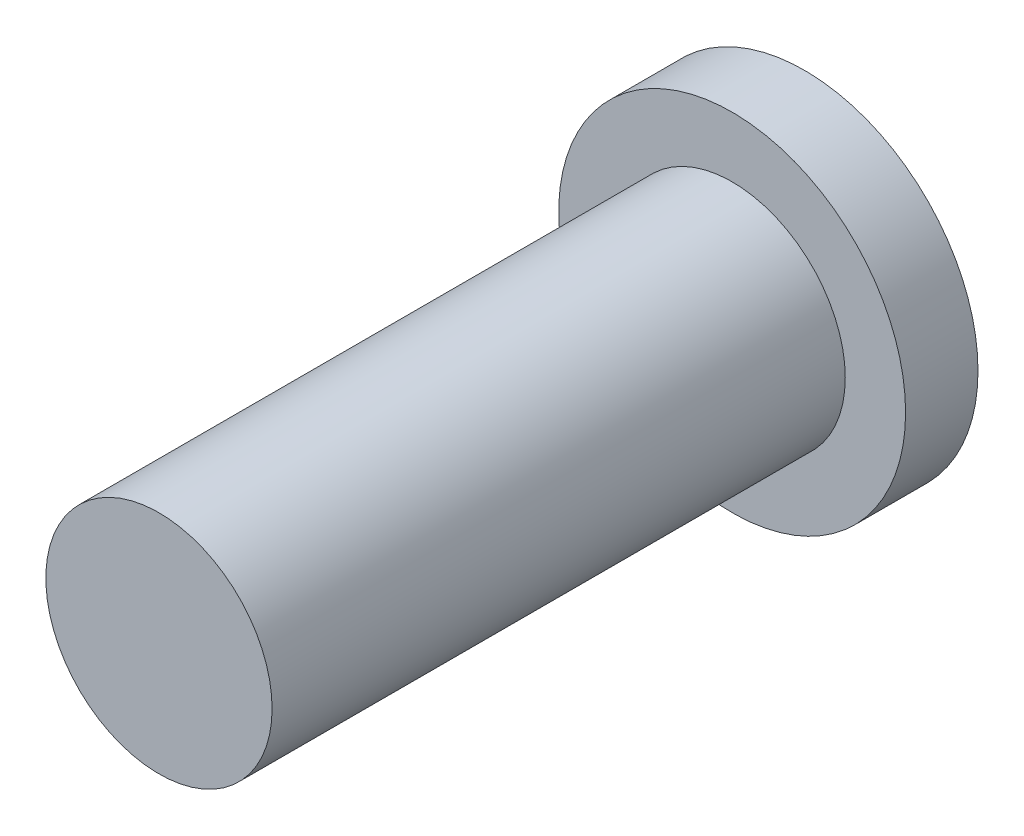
from build123d import *

# Parameters (mm, degrees)
SKETCH1_R           = 1.4605
BASE_EXTRUDE_DEPTH  = 0.6096
SKETCH2_R           = 0.9525
BOSS_EXTRUDE1_DEPTH = 4.826
CUT_EXTRUDE1_DEPTH  = 0.381


with BuildPart() as part:
    # Sketch1 → Base-Extrude (new body)
    with BuildSketch(Plane.XY):
        Circle(SKETCH1_R)
    extrude(amount=BASE_EXTRUDE_DEPTH)

    # Sketch2 → Boss-Extrude1 (add)
    with BuildSketch(Plane.XY.offset(0.6096)):
        Circle(SKETCH2_R)
    extrude(amount=BOSS_EXTRUDE1_DEPTH)

    # Sketch3 → Cut-Extrude1 (cut)
    with BuildSketch(Plane(origin=(0, 0, 0), x_dir=(-1, 0, 0), z_dir=(0, 0, -1))):
        Polygon((0.1905, -0.1905), (0.5715, -0.1905), (0.5715, 0.1905), (0.1905, 0.1905), (0.1905, 0.5715), (-0.1905, 0.5715), (-0.1905, 0.1905), (-0.5715, 0.1905), (-0.5715, -0.1905), (-0.1905, -0.1905), (-0.1905, -0.5715), (0.1905, -0.5715), align=None)
    extrude(amount=-CUT_EXTRUDE1_DEPTH, mode=Mode.SUBTRACT)


solid = part.part
